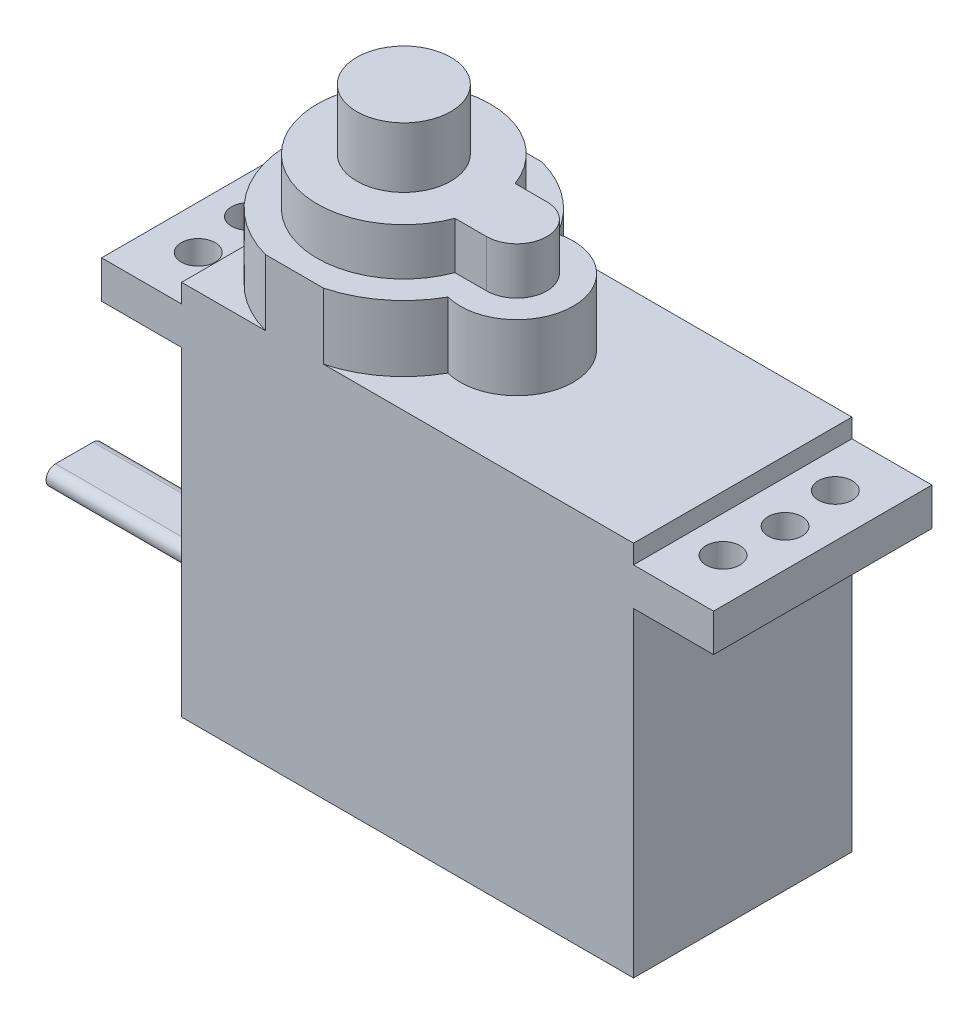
ISO-10303-21;
HEADER;
FILE_DESCRIPTION(('STEP AP214'),'2;1');
FILE_NAME('part.step','',(''),(''),'','','');
FILE_SCHEMA(('AUTOMOTIVE_DESIGN { 1 0 10303 214 1 1 1 1 }'));
ENDSEC;
DATA;
#1=APPLICATION_CONTEXT('core data for automotive mechanical design processes');
#2=APPLICATION_PROTOCOL_DEFINITION('international standard','automotive_design',2000,#1);
#3=PRODUCT_CONTEXT('',#1,'mechanical');
#4=PRODUCT('Part','Part','',(#3));
#5=PRODUCT_RELATED_PRODUCT_CATEGORY('part','',(#4));
#6=PRODUCT_DEFINITION_FORMATION('','',#4);
#7=PRODUCT_DEFINITION_CONTEXT('part definition',#1,'design');
#8=PRODUCT_DEFINITION('design','',#6,#7);
#9=PRODUCT_DEFINITION_SHAPE('','',#8);
#10=(LENGTH_UNIT() NAMED_UNIT(*) SI_UNIT(.MILLI.,.METRE.));
#11=(NAMED_UNIT(*) PLANE_ANGLE_UNIT() SI_UNIT($,.RADIAN.));
#12=(NAMED_UNIT(*) SI_UNIT($,.STERADIAN.) SOLID_ANGLE_UNIT());
#13=UNCERTAINTY_MEASURE_WITH_UNIT(LENGTH_MEASURE(1.E-05),#10,'distance_accuracy_value','');
#14=(GEOMETRIC_REPRESENTATION_CONTEXT(3) GLOBAL_UNCERTAINTY_ASSIGNED_CONTEXT((#13)) GLOBAL_UNIT_ASSIGNED_CONTEXT((#10,
#11,#12)) REPRESENTATION_CONTEXT('',''));
#15=CARTESIAN_POINT('',(0.,0.,0.));
#16=DIRECTION('',(0.,0.,1.));
#17=DIRECTION('',(1.,0.,0.));
#18=AXIS2_PLACEMENT_3D('',#15,#16,#17);
#19=CARTESIAN_POINT('',(-1.5,5.,2.8));
#20=DIRECTION('',(-1.,0.,0.));
#21=DIRECTION('',(0.,0.,1.));
#22=AXIS2_PLACEMENT_3D('',#19,#20,#21);
#23=PLANE('',#22);
#24=DIRECTION('',(0.,-1.,0.));
#25=VECTOR('',#24,1.);
#26=CARTESIAN_POINT('',(-1.5,5.,2.8));
#27=LINE('',#26,#25);
#28=CARTESIAN_POINT('',(-1.5,5.,2.8));
#29=VERTEX_POINT('',#28);
#30=CARTESIAN_POINT('',(-1.5,1.,2.8));
#31=VERTEX_POINT('',#30);
#32=EDGE_CURVE('E268',#29,#31,#27,.T.);
#33=ORIENTED_EDGE('',*,*,#32,.T.);
#34=DIRECTION('',(0.,0.,1.));
#35=VECTOR('',#34,1.);
#36=CARTESIAN_POINT('',(-1.5,1.,2.8));
#37=LINE('',#36,#35);
#38=CARTESIAN_POINT('',(-1.5,1.,8.8));
#39=VERTEX_POINT('',#38);
#40=EDGE_CURVE('E271',#31,#39,#37,.T.);
#41=ORIENTED_EDGE('',*,*,#40,.T.);
#42=DIRECTION('',(0.,1.,0.));
#43=VECTOR('',#42,1.);
#44=CARTESIAN_POINT('',(-1.5,5.,8.8));
#45=LINE('',#44,#43);
#46=CARTESIAN_POINT('',(-1.5,5.,8.8));
#47=VERTEX_POINT('',#46);
#48=EDGE_CURVE('E274',#39,#47,#45,.T.);
#49=ORIENTED_EDGE('',*,*,#48,.T.);
#50=DIRECTION('',(0.,0.,-1.));
#51=VECTOR('',#50,1.);
#52=CARTESIAN_POINT('',(-1.5,5.,2.8));
#53=LINE('',#52,#51);
#54=EDGE_CURVE('E276',#47,#29,#53,.T.);
#55=ORIENTED_EDGE('',*,*,#54,.T.);
#56=EDGE_LOOP('',(#33,#41,#49,#55));
#57=FACE_BOUND('',#56,.T.);
#58=DIRECTION('',(0.,0.,1.));
#59=VECTOR('',#58,1.);
#60=CARTESIAN_POINT('',(-1.5,2.5,4.8));
#61=LINE('',#60,#59);
#62=CARTESIAN_POINT('',(-1.5,2.5,4.8));
#63=VERTEX_POINT('',#62);
#64=CARTESIAN_POINT('',(-1.5,2.5,6.8));
#65=VERTEX_POINT('',#64);
#66=EDGE_CURVE('E926',#63,#65,#61,.T.);
#67=ORIENTED_EDGE('',*,*,#66,.F.);
#68=CARTESIAN_POINT('',(-1.5,3.,4.8));
#69=DIRECTION('',(-1.,0.,0.));
#70=DIRECTION('',(0.,0.,1.));
#71=AXIS2_PLACEMENT_3D('',#68,#69,#70);
#72=CIRCLE('',#71,0.499999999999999);
#73=CARTESIAN_POINT('',(-1.5,3.5,4.8));
#74=VERTEX_POINT('',#73);
#75=EDGE_CURVE('E259',#74,#63,#72,.T.);
#76=ORIENTED_EDGE('',*,*,#75,.F.);
#77=DIRECTION('',(0.,0.,-1.));
#78=VECTOR('',#77,1.);
#79=CARTESIAN_POINT('',(-1.5,3.5,6.8));
#80=LINE('',#79,#78);
#81=CARTESIAN_POINT('',(-1.5,3.5,6.8));
#82=VERTEX_POINT('',#81);
#83=EDGE_CURVE('E255',#82,#74,#80,.T.);
#84=ORIENTED_EDGE('',*,*,#83,.F.);
#85=CARTESIAN_POINT('',(-1.5,3.,6.8));
#86=DIRECTION('',(-1.,0.,0.));
#87=DIRECTION('',(0.,0.,1.));
#88=AXIS2_PLACEMENT_3D('',#85,#86,#87);
#89=CIRCLE('',#88,0.499999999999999);
#90=EDGE_CURVE('E923',#65,#82,#89,.T.);
#91=ORIENTED_EDGE('',*,*,#90,.F.);
#92=EDGE_LOOP('',(#67,#76,#84,#91));
#93=FACE_BOUND('',#92,.T.);
#94=ADVANCED_FACE('F34',(#57,#93),#23,.T.);
#95=CARTESIAN_POINT('',(0.,0.,11.6));
#96=DIRECTION('',(1.,0.,0.));
#97=DIRECTION('',(0.,0.,-1.));
#98=AXIS2_PLACEMENT_3D('',#95,#96,#97);
#99=PLANE('',#98);
#100=DIRECTION('',(0.,-1.,0.));
#101=VECTOR('',#100,1.);
#102=CARTESIAN_POINT('',(0.,0.,0.));
#103=LINE('',#102,#101);
#104=CARTESIAN_POINT('',(0.,17.,0.));
#105=VERTEX_POINT('',#104);
#106=CARTESIAN_POINT('',(0.,0.,0.));
#107=VERTEX_POINT('',#106);
#108=EDGE_CURVE('E406',#105,#107,#103,.T.);
#109=ORIENTED_EDGE('',*,*,#108,.T.);
#110=DIRECTION('',(0.,0.,-1.));
#111=VECTOR('',#110,1.);
#112=CARTESIAN_POINT('',(0.,0.,11.6));
#113=LINE('',#112,#111);
#114=CARTESIAN_POINT('',(0.,0.,11.6));
#115=VERTEX_POINT('',#114);
#116=EDGE_CURVE('E43',#115,#107,#113,.T.);
#117=ORIENTED_EDGE('',*,*,#116,.F.);
#118=DIRECTION('',(0.,-1.,0.));
#119=VECTOR('',#118,1.);
#120=CARTESIAN_POINT('',(0.,0.,11.6));
#121=LINE('',#120,#119);
#122=CARTESIAN_POINT('',(0.,17.,11.6));
#123=VERTEX_POINT('',#122);
#124=EDGE_CURVE('E407',#123,#115,#121,.T.);
#125=ORIENTED_EDGE('',*,*,#124,.F.);
#126=DIRECTION('',(0.,0.,-1.));
#127=VECTOR('',#126,1.);
#128=CARTESIAN_POINT('',(0.,17.,11.6));
#129=LINE('',#128,#127);
#130=EDGE_CURVE('E452',#123,#105,#129,.T.);
#131=ORIENTED_EDGE('',*,*,#130,.T.);
#132=EDGE_LOOP('',(#109,#117,#125,#131));
#133=FACE_BOUND('',#132,.T.);
#134=DIRECTION('',(0.,-1.,0.));
#135=VECTOR('',#134,1.);
#136=CARTESIAN_POINT('',(0.,5.,2.8));
#137=LINE('',#136,#135);
#138=CARTESIAN_POINT('',(0.,5.,2.8));
#139=VERTEX_POINT('',#138);
#140=CARTESIAN_POINT('',(0.,1.,2.8));
#141=VERTEX_POINT('',#140);
#142=EDGE_CURVE('E261',#139,#141,#137,.T.);
#143=ORIENTED_EDGE('',*,*,#142,.F.);
#144=DIRECTION('',(0.,0.,-1.));
#145=VECTOR('',#144,1.);
#146=CARTESIAN_POINT('',(0.,5.,2.8));
#147=LINE('',#146,#145);
#148=CARTESIAN_POINT('',(0.,5.,8.8));
#149=VERTEX_POINT('',#148);
#150=EDGE_CURVE('E272',#149,#139,#147,.T.);
#151=ORIENTED_EDGE('',*,*,#150,.F.);
#152=DIRECTION('',(0.,1.,0.));
#153=VECTOR('',#152,1.);
#154=CARTESIAN_POINT('',(0.,5.,8.8));
#155=LINE('',#154,#153);
#156=CARTESIAN_POINT('',(0.,1.,8.8));
#157=VERTEX_POINT('',#156);
#158=EDGE_CURVE('E280',#157,#149,#155,.T.);
#159=ORIENTED_EDGE('',*,*,#158,.F.);
#160=DIRECTION('',(0.,0.,1.));
#161=VECTOR('',#160,1.);
#162=CARTESIAN_POINT('',(0.,1.,2.8));
#163=LINE('',#162,#161);
#164=EDGE_CURVE('E59',#141,#157,#163,.T.);
#165=ORIENTED_EDGE('',*,*,#164,.F.);
#166=EDGE_LOOP('',(#143,#151,#159,#165));
#167=FACE_BOUND('',#166,.T.);
#168=ADVANCED_FACE('F36',(#133,#167),#99,.F.);
#169=CARTESIAN_POINT('',(12.,26.,5.8));
#170=DIRECTION('',(0.,1.,0.));
#171=DIRECTION('',(0.,0.,1.));
#172=AXIS2_PLACEMENT_3D('',#169,#170,#171);
#173=PLANE('',#172);
#174=CARTESIAN_POINT('',(12.,26.,5.8));
#175=DIRECTION('',(0.,1.,0.));
#176=DIRECTION('',(0.,0.,1.));
#177=AXIS2_PLACEMENT_3D('',#174,#175,#176);
#178=CIRCLE('',#177,1.6);
#179=CARTESIAN_POINT('',(12.,26.,7.4));
#180=VERTEX_POINT('',#179);
#181=CARTESIAN_POINT('',(12.,26.,4.2));
#182=VERTEX_POINT('',#181);
#183=EDGE_CURVE('E302',#180,#182,#178,.T.);
#184=ORIENTED_EDGE('',*,*,#183,.T.);
#185=DIRECTION('',(-1.,0.,0.));
#186=VECTOR('',#185,1.);
#187=CARTESIAN_POINT('',(12.,26.,4.2));
#188=LINE('',#187,#186);
#189=CARTESIAN_POINT('',(10.3127717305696,26.,4.2));
#190=VERTEX_POINT('',#189);
#191=EDGE_CURVE('E305',#182,#190,#188,.T.);
#192=ORIENTED_EDGE('',*,*,#191,.T.);
#193=CARTESIAN_POINT('',(6.,26.,5.8));
#194=DIRECTION('',(0.,1.,0.));
#195=DIRECTION('',(0.,0.,1.));
#196=AXIS2_PLACEMENT_3D('',#193,#194,#195);
#197=CIRCLE('',#196,4.6);
#198=CARTESIAN_POINT('',(10.3127717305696,26.,7.4));
#199=VERTEX_POINT('',#198);
#200=EDGE_CURVE('E308',#190,#199,#197,.T.);
#201=ORIENTED_EDGE('',*,*,#200,.T.);
#202=DIRECTION('',(1.,0.,0.));
#203=VECTOR('',#202,1.);
#204=CARTESIAN_POINT('',(12.,26.,7.4));
#205=LINE('',#204,#203);
#206=EDGE_CURVE('E310',#199,#180,#205,.T.);
#207=ORIENTED_EDGE('',*,*,#206,.T.);
#208=EDGE_LOOP('',(#184,#192,#201,#207));
#209=FACE_BOUND('',#208,.T.);
#210=CARTESIAN_POINT('',(6.,26.,5.8));
#211=DIRECTION('',(0.,1.,0.));
#212=DIRECTION('',(0.,0.,1.));
#213=AXIS2_PLACEMENT_3D('',#210,#211,#212);
#214=CIRCLE('',#213,2.5);
#215=CARTESIAN_POINT('',(6.,26.,8.3));
#216=VERTEX_POINT('',#215);
#217=EDGE_CURVE('E295',#216,#216,#214,.T.);
#218=ORIENTED_EDGE('',*,*,#217,.F.);
#219=EDGE_LOOP('',(#218));
#220=FACE_BOUND('',#219,.T.);
#221=ADVANCED_FACE('F520',(#209,#220),#173,.T.);
#222=CARTESIAN_POINT('',(6.,23.5,5.8));
#223=DIRECTION('',(0.,1.,0.));
#224=DIRECTION('',(0.,0.,1.));
#225=AXIS2_PLACEMENT_3D('',#222,#223,#224);
#226=PLANE('',#225);
#227=CARTESIAN_POINT('',(6.,23.5,5.8));
#228=DIRECTION('',(0.,1.,0.));
#229=DIRECTION('',(0.,0.,1.));
#230=AXIS2_PLACEMENT_3D('',#227,#228,#229);
#231=CIRCLE('',#230,6.);
#232=CARTESIAN_POINT('',(4.46377085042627,23.5,0.));
#233=VERTEX_POINT('',#232);
#234=CARTESIAN_POINT('',(4.46377085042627,23.5,11.6));
#235=VERTEX_POINT('',#234);
#236=EDGE_CURVE('E331',#233,#235,#231,.T.);
#237=ORIENTED_EDGE('',*,*,#236,.T.);
#238=DIRECTION('',(1.,0.,0.));
#239=VECTOR('',#238,1.);
#240=CARTESIAN_POINT('',(7.53622914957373,23.5,11.6));
#241=LINE('',#240,#239);
#242=CARTESIAN_POINT('',(7.53622914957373,23.5,11.6));
#243=VERTEX_POINT('',#242);
#244=EDGE_CURVE('E334',#235,#243,#241,.T.);
#245=ORIENTED_EDGE('',*,*,#244,.T.);
#246=CARTESIAN_POINT('',(6.,23.5,5.8));
#247=DIRECTION('',(0.,1.,0.));
#248=DIRECTION('',(0.,0.,1.));
#249=AXIS2_PLACEMENT_3D('',#246,#247,#248);
#250=CIRCLE('',#249,6.);
#251=CARTESIAN_POINT('',(11.25,23.5,8.70473750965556));
#252=VERTEX_POINT('',#251);
#253=EDGE_CURVE('E337',#243,#252,#250,.T.);
#254=ORIENTED_EDGE('',*,*,#253,.T.);
#255=CARTESIAN_POINT('',(12.,23.5,5.8));
#256=DIRECTION('',(0.,1.,0.));
#257=DIRECTION('',(0.,0.,1.));
#258=AXIS2_PLACEMENT_3D('',#255,#256,#257);
#259=CIRCLE('',#258,3.);
#260=CARTESIAN_POINT('',(11.25,23.5,2.89526249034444));
#261=VERTEX_POINT('',#260);
#262=EDGE_CURVE('E339',#252,#261,#259,.T.);
#263=ORIENTED_EDGE('',*,*,#262,.T.);
#264=CARTESIAN_POINT('',(6.,23.5,5.8));
#265=DIRECTION('',(0.,1.,0.));
#266=DIRECTION('',(0.,0.,1.));
#267=AXIS2_PLACEMENT_3D('',#264,#265,#266);
#268=CIRCLE('',#267,6.);
#269=CARTESIAN_POINT('',(7.53622914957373,23.5,0.));
#270=VERTEX_POINT('',#269);
#271=EDGE_CURVE('E341',#261,#270,#268,.T.);
#272=ORIENTED_EDGE('',*,*,#271,.T.);
#273=DIRECTION('',(-1.,0.,0.));
#274=VECTOR('',#273,1.);
#275=CARTESIAN_POINT('',(7.53622914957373,23.5,0.));
#276=LINE('',#275,#274);
#277=EDGE_CURVE('E343',#270,#233,#276,.T.);
#278=ORIENTED_EDGE('',*,*,#277,.T.);
#279=EDGE_LOOP('',(#237,#245,#254,#263,#272,#278));
#280=FACE_BOUND('',#279,.T.);
#281=DIRECTION('',(-1.,0.,0.));
#282=VECTOR('',#281,1.);
#283=CARTESIAN_POINT('',(12.,23.5,4.2));
#284=LINE('',#283,#282);
#285=CARTESIAN_POINT('',(12.,23.5,4.2));
#286=VERTEX_POINT('',#285);
#287=CARTESIAN_POINT('',(10.3127717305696,23.5,4.2));
#288=VERTEX_POINT('',#287);
#289=EDGE_CURVE('E315',#286,#288,#284,.T.);
#290=ORIENTED_EDGE('',*,*,#289,.F.);
#291=CARTESIAN_POINT('',(12.,23.5,5.8));
#292=DIRECTION('',(0.,1.,0.));
#293=DIRECTION('',(0.,0.,1.));
#294=AXIS2_PLACEMENT_3D('',#291,#292,#293);
#295=CIRCLE('',#294,1.6);
#296=CARTESIAN_POINT('',(12.,23.5,7.4));
#297=VERTEX_POINT('',#296);
#298=EDGE_CURVE('E299',#297,#286,#295,.T.);
#299=ORIENTED_EDGE('',*,*,#298,.F.);
#300=DIRECTION('',(1.,0.,0.));
#301=VECTOR('',#300,1.);
#302=CARTESIAN_POINT('',(12.,23.5,7.4));
#303=LINE('',#302,#301);
#304=CARTESIAN_POINT('',(10.3127717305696,23.5,7.4));
#305=VERTEX_POINT('',#304);
#306=EDGE_CURVE('E306',#305,#297,#303,.T.);
#307=ORIENTED_EDGE('',*,*,#306,.F.);
#308=CARTESIAN_POINT('',(6.,23.5,5.8));
#309=DIRECTION('',(0.,1.,0.));
#310=DIRECTION('',(0.,0.,1.));
#311=AXIS2_PLACEMENT_3D('',#308,#309,#310);
#312=CIRCLE('',#311,4.6);
#313=EDGE_CURVE('E317',#288,#305,#312,.T.);
#314=ORIENTED_EDGE('',*,*,#313,.F.);
#315=EDGE_LOOP('',(#290,#299,#307,#314));
#316=FACE_BOUND('',#315,.T.);
#317=ADVANCED_FACE('F553',(#280,#316),#226,.T.);
#318=CARTESIAN_POINT('',(0.,20.,11.6));
#319=DIRECTION('',(0.,-1.,0.));
#320=DIRECTION('',(0.,0.,-1.));
#321=AXIS2_PLACEMENT_3D('',#318,#319,#320);
#322=PLANE('',#321);
#323=CARTESIAN_POINT('',(6.,20.,5.8));
#324=DIRECTION('',(0.,1.,0.));
#325=DIRECTION('',(0.,0.,1.));
#326=AXIS2_PLACEMENT_3D('',#323,#324,#325);
#327=CIRCLE('',#326,6.);
#328=CARTESIAN_POINT('',(4.46377085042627,20.,0.));
#329=VERTEX_POINT('',#328);
#330=CARTESIAN_POINT('',(0.,20.,5.8));
#331=VERTEX_POINT('',#330);
#332=EDGE_CURVE('E330',#329,#331,#327,.T.);
#333=ORIENTED_EDGE('',*,*,#332,.F.);
#334=DIRECTION('',(-1.,0.,0.));
#335=VECTOR('',#334,1.);
#336=CARTESIAN_POINT('',(0.,20.,0.));
#337=LINE('',#336,#335);
#338=CARTESIAN_POINT('',(0.,20.,0.));
#339=VERTEX_POINT('',#338);
#340=EDGE_CURVE('E433',#329,#339,#337,.T.);
#341=ORIENTED_EDGE('',*,*,#340,.T.);
#342=DIRECTION('',(0.,0.,-1.));
#343=VECTOR('',#342,1.);
#344=CARTESIAN_POINT('',(0.,20.,11.6));
#345=LINE('',#344,#343);
#346=EDGE_CURVE('E465',#331,#339,#345,.T.);
#347=ORIENTED_EDGE('',*,*,#346,.F.);
#348=EDGE_LOOP('',(#333,#341,#347));
#349=FACE_BOUND('',#348,.T.);
#350=ADVANCED_FACE('F573',(#349),#322,.F.);
#351=CARTESIAN_POINT('',(4.46377085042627,20.,11.6));
#352=VERTEX_POINT('',#351);
#353=EDGE_CURVE('E11',#331,#352,#327,.T.);
#354=ORIENTED_EDGE('',*,*,#353,.F.);
#355=CARTESIAN_POINT('',(0.,20.,11.6));
#356=VERTEX_POINT('',#355);
#357=EDGE_CURVE('E466',#356,#331,#345,.T.);
#358=ORIENTED_EDGE('',*,*,#357,.F.);
#359=DIRECTION('',(-1.,0.,0.));
#360=VECTOR('',#359,1.);
#361=CARTESIAN_POINT('',(0.,20.,11.6));
#362=LINE('',#361,#360);
#363=EDGE_CURVE('E423',#352,#356,#362,.T.);
#364=ORIENTED_EDGE('',*,*,#363,.F.);
#365=EDGE_LOOP('',(#354,#358,#364));
#366=FACE_BOUND('',#365,.T.);
#367=ADVANCED_FACE('F720',(#366),#322,.F.);
#368=CARTESIAN_POINT('',(6.,20.,5.8));
#369=DIRECTION('',(0.,1.,0.));
#370=DIRECTION('',(0.,0.,1.));
#371=AXIS2_PLACEMENT_3D('',#368,#369,#370);
#372=CIRCLE('',#371,6.);
#373=CARTESIAN_POINT('',(11.25,20.,2.89526249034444));
#374=VERTEX_POINT('',#373);
#375=CARTESIAN_POINT('',(7.53622914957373,20.,0.));
#376=VERTEX_POINT('',#375);
#377=EDGE_CURVE('E335',#374,#376,#372,.T.);
#378=ORIENTED_EDGE('',*,*,#377,.F.);
#379=CARTESIAN_POINT('',(12.,20.,5.8));
#380=DIRECTION('',(0.,1.,0.));
#381=DIRECTION('',(0.,0.,1.));
#382=AXIS2_PLACEMENT_3D('',#379,#380,#381);
#383=CIRCLE('',#382,3.);
#384=CARTESIAN_POINT('',(11.25,20.,8.70473750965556));
#385=VERTEX_POINT('',#384);
#386=EDGE_CURVE('E348',#385,#374,#383,.T.);
#387=ORIENTED_EDGE('',*,*,#386,.F.);
#388=CARTESIAN_POINT('',(6.,20.,5.8));
#389=DIRECTION('',(0.,1.,0.));
#390=DIRECTION('',(0.,0.,1.));
#391=AXIS2_PLACEMENT_3D('',#388,#389,#390);
#392=CIRCLE('',#391,6.);
#393=CARTESIAN_POINT('',(7.53622914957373,20.,11.6));
#394=VERTEX_POINT('',#393);
#395=EDGE_CURVE('E357',#394,#385,#392,.T.);
#396=ORIENTED_EDGE('',*,*,#395,.F.);
#397=CARTESIAN_POINT('',(24.,20.,11.6));
#398=VERTEX_POINT('',#397);
#399=EDGE_CURVE('E430',#398,#394,#362,.T.);
#400=ORIENTED_EDGE('',*,*,#399,.F.);
#401=DIRECTION('',(0.,0.,-1.));
#402=VECTOR('',#401,1.);
#403=CARTESIAN_POINT('',(24.,20.,11.6));
#404=LINE('',#403,#402);
#405=CARTESIAN_POINT('',(24.,20.,0.));
#406=VERTEX_POINT('',#405);
#407=EDGE_CURVE('E469',#398,#406,#404,.T.);
#408=ORIENTED_EDGE('',*,*,#407,.T.);
#409=EDGE_CURVE('E437',#406,#376,#337,.T.);
#410=ORIENTED_EDGE('',*,*,#409,.T.);
#411=EDGE_LOOP('',(#378,#387,#396,#400,#408,#410));
#412=FACE_BOUND('',#411,.T.);
#413=ADVANCED_FACE('F683',(#412),#322,.F.);
#414=CARTESIAN_POINT('',(0.,0.,11.6));
#415=DIRECTION('',(0.,1.,0.));
#416=DIRECTION('',(0.,0.,1.));
#417=AXIS2_PLACEMENT_3D('',#414,#415,#416);
#418=PLANE('',#417);
#419=DIRECTION('',(1.,0.,0.));
#420=VECTOR('',#419,1.);
#421=CARTESIAN_POINT('',(0.,0.,0.));
#422=LINE('',#421,#420);
#423=CARTESIAN_POINT('',(24.,0.,0.));
#424=VERTEX_POINT('',#423);
#425=EDGE_CURVE('E630',#107,#424,#422,.T.);
#426=ORIENTED_EDGE('',*,*,#425,.T.);
#427=DIRECTION('',(0.,0.,-1.));
#428=VECTOR('',#427,1.);
#429=CARTESIAN_POINT('',(24.,0.,11.6));
#430=LINE('',#429,#428);
#431=CARTESIAN_POINT('',(24.,0.,11.6));
#432=VERTEX_POINT('',#431);
#433=EDGE_CURVE('E484',#432,#424,#430,.T.);
#434=ORIENTED_EDGE('',*,*,#433,.F.);
#435=DIRECTION('',(1.,0.,0.));
#436=VECTOR('',#435,1.);
#437=CARTESIAN_POINT('',(0.,0.,11.6));
#438=LINE('',#437,#436);
#439=EDGE_CURVE('E410',#115,#432,#438,.T.);
#440=ORIENTED_EDGE('',*,*,#439,.F.);
#441=ORIENTED_EDGE('',*,*,#116,.T.);
#442=EDGE_LOOP('',(#426,#434,#440,#441));
#443=FACE_BOUND('',#442,.T.);
#444=ADVANCED_FACE('F663',(#443),#418,.F.);
#445=CARTESIAN_POINT('',(24.,0.,11.6));
#446=DIRECTION('',(-1.,0.,0.));
#447=DIRECTION('',(0.,0.,1.));
#448=AXIS2_PLACEMENT_3D('',#445,#446,#447);
#449=PLANE('',#448);
#450=DIRECTION('',(0.,1.,0.));
#451=VECTOR('',#450,1.);
#452=CARTESIAN_POINT('',(24.,0.,0.));
#453=LINE('',#452,#451);
#454=CARTESIAN_POINT('',(24.,17.,0.));
#455=VERTEX_POINT('',#454);
#456=EDGE_CURVE('E618',#424,#455,#453,.T.);
#457=ORIENTED_EDGE('',*,*,#456,.T.);
#458=DIRECTION('',(0.,0.,-1.));
#459=VECTOR('',#458,1.);
#460=CARTESIAN_POINT('',(24.,17.,11.6));
#461=LINE('',#460,#459);
#462=CARTESIAN_POINT('',(24.,17.,11.6));
#463=VERTEX_POINT('',#462);
#464=EDGE_CURVE('E481',#463,#455,#461,.T.);
#465=ORIENTED_EDGE('',*,*,#464,.F.);
#466=DIRECTION('',(0.,1.,0.));
#467=VECTOR('',#466,1.);
#468=CARTESIAN_POINT('',(24.,0.,11.6));
#469=LINE('',#468,#467);
#470=EDGE_CURVE('E413',#432,#463,#469,.T.);
#471=ORIENTED_EDGE('',*,*,#470,.F.);
#472=ORIENTED_EDGE('',*,*,#433,.T.);
#473=EDGE_LOOP('',(#457,#465,#471,#472));
#474=FACE_BOUND('',#473,.T.);
#475=ADVANCED_FACE('F602',(#474),#449,.F.);
#476=CARTESIAN_POINT('',(24.,17.,11.6));
#477=DIRECTION('',(0.,1.,0.));
#478=DIRECTION('',(0.,0.,1.));
#479=AXIS2_PLACEMENT_3D('',#476,#477,#478);
#480=PLANE('',#479);
#481=CARTESIAN_POINT('',(25.9342105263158,17.,2.8166667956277));
#482=DIRECTION('',(0.,1.,0.));
#483=DIRECTION('',(0.,0.,1.));
#484=AXIS2_PLACEMENT_3D('',#481,#482,#483);
#485=CIRCLE('',#484,0.9);
#486=CARTESIAN_POINT('',(25.9342105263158,17.,3.7166667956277));
#487=VERTEX_POINT('',#486);
#488=EDGE_CURVE('E378',#487,#487,#485,.T.);
#489=ORIENTED_EDGE('',*,*,#488,.T.);
#490=EDGE_LOOP('',(#489));
#491=FACE_BOUND('',#490,.T.);
#492=CARTESIAN_POINT('',(25.9342105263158,17.,8.78333320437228));
#493=DIRECTION('',(0.,1.,0.));
#494=DIRECTION('',(0.,0.,1.));
#495=AXIS2_PLACEMENT_3D('',#492,#493,#494);
#496=CIRCLE('',#495,0.9);
#497=CARTESIAN_POINT('',(25.9342105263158,17.,9.68333320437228));
#498=VERTEX_POINT('',#497);
#499=EDGE_CURVE('E385',#498,#498,#496,.T.);
#500=ORIENTED_EDGE('',*,*,#499,.T.);
#501=EDGE_LOOP('',(#500));
#502=FACE_BOUND('',#501,.T.);
#503=CARTESIAN_POINT('',(26.25,17.,5.79999999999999));
#504=DIRECTION('',(0.,1.,0.));
#505=DIRECTION('',(0.,0.,1.));
#506=AXIS2_PLACEMENT_3D('',#503,#504,#505);
#507=CIRCLE('',#506,0.9);
#508=CARTESIAN_POINT('',(26.25,17.,6.69999999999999));
#509=VERTEX_POINT('',#508);
#510=EDGE_CURVE('E403',#509,#509,#507,.T.);
#511=ORIENTED_EDGE('',*,*,#510,.T.);
#512=EDGE_LOOP('',(#511));
#513=FACE_BOUND('',#512,.T.);
#514=DIRECTION('',(1.,0.,0.));
#515=VECTOR('',#514,1.);
#516=CARTESIAN_POINT('',(24.,17.,0.));
#517=LINE('',#516,#515);
#518=CARTESIAN_POINT('',(28.25,17.,0.));
#519=VERTEX_POINT('',#518);
#520=EDGE_CURVE('E610',#455,#519,#517,.T.);
#521=ORIENTED_EDGE('',*,*,#520,.T.);
#522=DIRECTION('',(0.,0.,-1.));
#523=VECTOR('',#522,1.);
#524=CARTESIAN_POINT('',(28.25,17.,11.6));
#525=LINE('',#524,#523);
#526=CARTESIAN_POINT('',(28.25,17.,11.6));
#527=VERTEX_POINT('',#526);
#528=EDGE_CURVE('E478',#527,#519,#525,.T.);
#529=ORIENTED_EDGE('',*,*,#528,.F.);
#530=DIRECTION('',(1.,0.,0.));
#531=VECTOR('',#530,1.);
#532=CARTESIAN_POINT('',(24.,17.,11.6));
#533=LINE('',#532,#531);
#534=EDGE_CURVE('E415',#463,#527,#533,.T.);
#535=ORIENTED_EDGE('',*,*,#534,.F.);
#536=ORIENTED_EDGE('',*,*,#464,.T.);
#537=EDGE_LOOP('',(#521,#529,#535,#536));
#538=FACE_BOUND('',#537,.T.);
#539=ADVANCED_FACE('F598',(#491,#502,#513,#538),#480,.F.);
#540=CARTESIAN_POINT('',(28.25,17.,11.6));
#541=DIRECTION('',(-1.,0.,0.));
#542=DIRECTION('',(0.,0.,1.));
#543=AXIS2_PLACEMENT_3D('',#540,#541,#542);
#544=PLANE('',#543);
#545=DIRECTION('',(0.,1.,0.));
#546=VECTOR('',#545,1.);
#547=CARTESIAN_POINT('',(28.25,17.,0.));
#548=LINE('',#547,#546);
#549=CARTESIAN_POINT('',(28.25,19.,0.));
#550=VERTEX_POINT('',#549);
#551=EDGE_CURVE('E617',#519,#550,#548,.T.);
#552=ORIENTED_EDGE('',*,*,#551,.T.);
#553=DIRECTION('',(0.,0.,-1.));
#554=VECTOR('',#553,1.);
#555=CARTESIAN_POINT('',(28.25,19.,11.6));
#556=LINE('',#555,#554);
#557=CARTESIAN_POINT('',(28.25,19.,11.6));
#558=VERTEX_POINT('',#557);
#559=EDGE_CURVE('E475',#558,#550,#556,.T.);
#560=ORIENTED_EDGE('',*,*,#559,.F.);
#561=DIRECTION('',(0.,1.,0.));
#562=VECTOR('',#561,1.);
#563=CARTESIAN_POINT('',(28.25,17.,11.6));
#564=LINE('',#563,#562);
#565=EDGE_CURVE('E417',#527,#558,#564,.T.);
#566=ORIENTED_EDGE('',*,*,#565,.F.);
#567=ORIENTED_EDGE('',*,*,#528,.T.);
#568=EDGE_LOOP('',(#552,#560,#566,#567));
#569=FACE_BOUND('',#568,.T.);
#570=ADVANCED_FACE('F601',(#569),#544,.F.);
#571=CARTESIAN_POINT('',(28.25,19.,11.6));
#572=DIRECTION('',(0.,-1.,0.));
#573=DIRECTION('',(1.,0.,0.));
#574=AXIS2_PLACEMENT_3D('',#571,#572,#573);
#575=PLANE('',#574);
#576=CARTESIAN_POINT('',(25.9342105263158,19.,2.8166667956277));
#577=DIRECTION('',(0.,1.,0.));
#578=DIRECTION('',(0.,0.,1.));
#579=AXIS2_PLACEMENT_3D('',#576,#577,#578);
#580=CIRCLE('',#579,0.9);
#581=CARTESIAN_POINT('',(25.9342105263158,19.,3.7166667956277));
#582=VERTEX_POINT('',#581);
#583=EDGE_CURVE('E375',#582,#582,#580,.T.);
#584=ORIENTED_EDGE('',*,*,#583,.F.);
#585=EDGE_LOOP('',(#584));
#586=FACE_BOUND('',#585,.T.);
#587=CARTESIAN_POINT('',(25.9342105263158,19.,8.78333320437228));
#588=DIRECTION('',(0.,1.,0.));
#589=DIRECTION('',(0.,0.,1.));
#590=AXIS2_PLACEMENT_3D('',#587,#588,#589);
#591=CIRCLE('',#590,0.9);
#592=CARTESIAN_POINT('',(25.9342105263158,19.,9.68333320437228));
#593=VERTEX_POINT('',#592);
#594=EDGE_CURVE('E382',#593,#593,#591,.T.);
#595=ORIENTED_EDGE('',*,*,#594,.F.);
#596=EDGE_LOOP('',(#595));
#597=FACE_BOUND('',#596,.T.);
#598=CARTESIAN_POINT('',(26.25,19.,5.79999999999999));
#599=DIRECTION('',(0.,1.,0.));
#600=DIRECTION('',(0.,0.,1.));
#601=AXIS2_PLACEMENT_3D('',#598,#599,#600);
#602=CIRCLE('',#601,0.9);
#603=CARTESIAN_POINT('',(26.25,19.,6.69999999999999));
#604=VERTEX_POINT('',#603);
#605=EDGE_CURVE('E400',#604,#604,#602,.T.);
#606=ORIENTED_EDGE('',*,*,#605,.F.);
#607=EDGE_LOOP('',(#606));
#608=FACE_BOUND('',#607,.T.);
#609=DIRECTION('',(-1.,0.,0.));
#610=VECTOR('',#609,1.);
#611=CARTESIAN_POINT('',(28.25,19.,0.));
#612=LINE('',#611,#610);
#613=CARTESIAN_POINT('',(24.,19.,0.));
#614=VERTEX_POINT('',#613);
#615=EDGE_CURVE('E626',#550,#614,#612,.T.);
#616=ORIENTED_EDGE('',*,*,#615,.T.);
#617=DIRECTION('',(0.,0.,-1.));
#618=VECTOR('',#617,1.);
#619=CARTESIAN_POINT('',(24.,19.,11.6));
#620=LINE('',#619,#618);
#621=CARTESIAN_POINT('',(24.,19.,11.6));
#622=VERTEX_POINT('',#621);
#623=EDGE_CURVE('E472',#622,#614,#620,.T.);
#624=ORIENTED_EDGE('',*,*,#623,.F.);
#625=DIRECTION('',(-1.,0.,0.));
#626=VECTOR('',#625,1.);
#627=CARTESIAN_POINT('',(28.25,19.,11.6));
#628=LINE('',#627,#626);
#629=EDGE_CURVE('E419',#558,#622,#628,.T.);
#630=ORIENTED_EDGE('',*,*,#629,.F.);
#631=ORIENTED_EDGE('',*,*,#559,.T.);
#632=EDGE_LOOP('',(#616,#624,#630,#631));
#633=FACE_BOUND('',#632,.T.);
#634=ADVANCED_FACE('F702',(#586,#597,#608,#633),#575,.F.);
#635=CARTESIAN_POINT('',(24.,19.,11.6));
#636=DIRECTION('',(-1.,0.,0.));
#637=DIRECTION('',(0.,0.,1.));
#638=AXIS2_PLACEMENT_3D('',#635,#636,#637);
#639=PLANE('',#638);
#640=DIRECTION('',(0.,1.,0.));
#641=VECTOR('',#640,1.);
#642=CARTESIAN_POINT('',(24.,19.,0.));
#643=LINE('',#642,#641);
#644=EDGE_CURVE('E438',#614,#406,#643,.T.);
#645=ORIENTED_EDGE('',*,*,#644,.T.);
#646=ORIENTED_EDGE('',*,*,#407,.F.);
#647=DIRECTION('',(0.,1.,0.));
#648=VECTOR('',#647,1.);
#649=CARTESIAN_POINT('',(24.,19.,11.6));
#650=LINE('',#649,#648);
#651=EDGE_CURVE('E421',#622,#398,#650,.T.);
#652=ORIENTED_EDGE('',*,*,#651,.F.);
#653=ORIENTED_EDGE('',*,*,#623,.T.);
#654=EDGE_LOOP('',(#645,#646,#652,#653));
#655=FACE_BOUND('',#654,.T.);
#656=ADVANCED_FACE('F698',(#655),#639,.F.);
#657=CARTESIAN_POINT('',(0.,19.,11.6));
#658=DIRECTION('',(1.,0.,0.));
#659=DIRECTION('',(0.,1.,0.));
#660=AXIS2_PLACEMENT_3D('',#657,#658,#659);
#661=PLANE('',#660);
#662=DIRECTION('',(0.,-1.,0.));
#663=VECTOR('',#662,1.);
#664=CARTESIAN_POINT('',(0.,19.,0.));
#665=LINE('',#664,#663);
#666=CARTESIAN_POINT('',(0.,19.,0.));
#667=VERTEX_POINT('',#666);
#668=EDGE_CURVE('E444',#339,#667,#665,.T.);
#669=ORIENTED_EDGE('',*,*,#668,.T.);
#670=DIRECTION('',(0.,0.,-1.));
#671=VECTOR('',#670,1.);
#672=CARTESIAN_POINT('',(0.,19.,11.6));
#673=LINE('',#672,#671);
#674=CARTESIAN_POINT('',(0.,19.,11.6));
#675=VERTEX_POINT('',#674);
#676=EDGE_CURVE('E462',#675,#667,#673,.T.);
#677=ORIENTED_EDGE('',*,*,#676,.F.);
#678=DIRECTION('',(0.,-1.,0.));
#679=VECTOR('',#678,1.);
#680=CARTESIAN_POINT('',(0.,19.,11.6));
#681=LINE('',#680,#679);
#682=EDGE_CURVE('E426',#356,#675,#681,.T.);
#683=ORIENTED_EDGE('',*,*,#682,.F.);
#684=ORIENTED_EDGE('',*,*,#357,.T.);
#685=ORIENTED_EDGE('',*,*,#346,.T.);
#686=EDGE_LOOP('',(#669,#677,#683,#684,#685));
#687=FACE_BOUND('',#686,.T.);
#688=ADVANCED_FACE('F646',(#687),#661,.F.);
#689=CARTESIAN_POINT('',(0.,19.,11.6));
#690=DIRECTION('',(0.,-1.,0.));
#691=DIRECTION('',(0.,0.,-1.));
#692=AXIS2_PLACEMENT_3D('',#689,#690,#691);
#693=PLANE('',#692);
#694=CARTESIAN_POINT('',(-1.93421052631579,19.,8.78333320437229));
#695=DIRECTION('',(0.,1.,0.));
#696=DIRECTION('',(0.,0.,1.));
#697=AXIS2_PLACEMENT_3D('',#694,#695,#696);
#698=CIRCLE('',#697,0.9);
#699=CARTESIAN_POINT('',(-1.93421052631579,19.,9.68333320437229));
#700=VERTEX_POINT('',#699);
#701=EDGE_CURVE('E388',#700,#700,#698,.T.);
#702=ORIENTED_EDGE('',*,*,#701,.F.);
#703=EDGE_LOOP('',(#702));
#704=FACE_BOUND('',#703,.T.);
#705=CARTESIAN_POINT('',(-1.93421052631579,19.,2.81666679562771));
#706=DIRECTION('',(0.,1.,0.));
#707=DIRECTION('',(0.,0.,1.));
#708=AXIS2_PLACEMENT_3D('',#705,#706,#707);
#709=CIRCLE('',#708,0.9);
#710=CARTESIAN_POINT('',(-1.93421052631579,19.,3.71666679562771));
#711=VERTEX_POINT('',#710);
#712=EDGE_CURVE('E392',#711,#711,#709,.T.);
#713=ORIENTED_EDGE('',*,*,#712,.F.);
#714=EDGE_LOOP('',(#713));
#715=FACE_BOUND('',#714,.T.);
#716=CARTESIAN_POINT('',(-2.25,19.,5.8));
#717=DIRECTION('',(0.,1.,0.));
#718=DIRECTION('',(0.,0.,1.));
#719=AXIS2_PLACEMENT_3D('',#716,#717,#718);
#720=CIRCLE('',#719,0.9);
#721=CARTESIAN_POINT('',(-2.25,19.,6.7));
#722=VERTEX_POINT('',#721);
#723=EDGE_CURVE('E396',#722,#722,#720,.T.);
#724=ORIENTED_EDGE('',*,*,#723,.F.);
#725=EDGE_LOOP('',(#724));
#726=FACE_BOUND('',#725,.T.);
#727=DIRECTION('',(-1.,0.,0.));
#728=VECTOR('',#727,1.);
#729=CARTESIAN_POINT('',(0.,19.,0.));
#730=LINE('',#729,#728);
#731=CARTESIAN_POINT('',(-4.25,19.,0.));
#732=VERTEX_POINT('',#731);
#733=EDGE_CURVE('E447',#667,#732,#730,.T.);
#734=ORIENTED_EDGE('',*,*,#733,.T.);
#735=DIRECTION('',(0.,0.,-1.));
#736=VECTOR('',#735,1.);
#737=CARTESIAN_POINT('',(-4.25,19.,11.6));
#738=LINE('',#737,#736);
#739=CARTESIAN_POINT('',(-4.25,19.,11.6));
#740=VERTEX_POINT('',#739);
#741=EDGE_CURVE('E459',#740,#732,#738,.T.);
#742=ORIENTED_EDGE('',*,*,#741,.F.);
#743=DIRECTION('',(-1.,0.,0.));
#744=VECTOR('',#743,1.);
#745=CARTESIAN_POINT('',(0.,19.,11.6));
#746=LINE('',#745,#744);
#747=EDGE_CURVE('E636',#675,#740,#746,.T.);
#748=ORIENTED_EDGE('',*,*,#747,.F.);
#749=ORIENTED_EDGE('',*,*,#676,.T.);
#750=EDGE_LOOP('',(#734,#742,#748,#749));
#751=FACE_BOUND('',#750,.T.);
#752=ADVANCED_FACE('F650',(#704,#715,#726,#751),#693,.F.);
#753=CARTESIAN_POINT('',(-4.25,17.,11.6));
#754=DIRECTION('',(1.,0.,0.));
#755=DIRECTION('',(0.,1.,0.));
#756=AXIS2_PLACEMENT_3D('',#753,#754,#755);
#757=PLANE('',#756);
#758=DIRECTION('',(0.,-1.,0.));
#759=VECTOR('',#758,1.);
#760=CARTESIAN_POINT('',(-4.25,17.,0.));
#761=LINE('',#760,#759);
#762=CARTESIAN_POINT('',(-4.25,17.,0.));
#763=VERTEX_POINT('',#762);
#764=EDGE_CURVE('E449',#732,#763,#761,.T.);
#765=ORIENTED_EDGE('',*,*,#764,.T.);
#766=DIRECTION('',(0.,0.,-1.));
#767=VECTOR('',#766,1.);
#768=CARTESIAN_POINT('',(-4.25,17.,11.6));
#769=LINE('',#768,#767);
#770=CARTESIAN_POINT('',(-4.25,17.,11.6));
#771=VERTEX_POINT('',#770);
#772=EDGE_CURVE('E455',#771,#763,#769,.T.);
#773=ORIENTED_EDGE('',*,*,#772,.F.);
#774=DIRECTION('',(0.,-1.,0.));
#775=VECTOR('',#774,1.);
#776=CARTESIAN_POINT('',(-4.25,17.,11.6));
#777=LINE('',#776,#775);
#778=EDGE_CURVE('E635',#740,#771,#777,.T.);
#779=ORIENTED_EDGE('',*,*,#778,.F.);
#780=ORIENTED_EDGE('',*,*,#741,.T.);
#781=EDGE_LOOP('',(#765,#773,#779,#780));
#782=FACE_BOUND('',#781,.T.);
#783=ADVANCED_FACE('F655',(#782),#757,.F.);
#784=CARTESIAN_POINT('',(-4.25,17.,11.6));
#785=DIRECTION('',(0.,1.,0.));
#786=DIRECTION('',(0.,0.,1.));
#787=AXIS2_PLACEMENT_3D('',#784,#785,#786);
#788=PLANE('',#787);
#789=CARTESIAN_POINT('',(-1.93421052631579,17.,8.78333320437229));
#790=DIRECTION('',(0.,1.,0.));
#791=DIRECTION('',(0.,0.,1.));
#792=AXIS2_PLACEMENT_3D('',#789,#790,#791);
#793=CIRCLE('',#792,0.9);
#794=CARTESIAN_POINT('',(-1.93421052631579,17.,9.68333320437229));
#795=VERTEX_POINT('',#794);
#796=EDGE_CURVE('E391',#795,#795,#793,.T.);
#797=ORIENTED_EDGE('',*,*,#796,.T.);
#798=EDGE_LOOP('',(#797));
#799=FACE_BOUND('',#798,.T.);
#800=CARTESIAN_POINT('',(-1.93421052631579,17.,2.81666679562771));
#801=DIRECTION('',(0.,1.,0.));
#802=DIRECTION('',(0.,0.,1.));
#803=AXIS2_PLACEMENT_3D('',#800,#801,#802);
#804=CIRCLE('',#803,0.9);
#805=CARTESIAN_POINT('',(-1.93421052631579,17.,3.71666679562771));
#806=VERTEX_POINT('',#805);
#807=EDGE_CURVE('E395',#806,#806,#804,.T.);
#808=ORIENTED_EDGE('',*,*,#807,.T.);
#809=EDGE_LOOP('',(#808));
#810=FACE_BOUND('',#809,.T.);
#811=CARTESIAN_POINT('',(-2.25,17.,5.8));
#812=DIRECTION('',(0.,1.,0.));
#813=DIRECTION('',(0.,0.,1.));
#814=AXIS2_PLACEMENT_3D('',#811,#812,#813);
#815=CIRCLE('',#814,0.9);
#816=CARTESIAN_POINT('',(-2.25,17.,6.7));
#817=VERTEX_POINT('',#816);
#818=EDGE_CURVE('E399',#817,#817,#815,.T.);
#819=ORIENTED_EDGE('',*,*,#818,.T.);
#820=EDGE_LOOP('',(#819));
#821=FACE_BOUND('',#820,.T.);
#822=DIRECTION('',(1.,0.,0.));
#823=VECTOR('',#822,1.);
#824=CARTESIAN_POINT('',(-4.25,17.,0.));
#825=LINE('',#824,#823);
#826=EDGE_CURVE('E411',#763,#105,#825,.T.);
#827=ORIENTED_EDGE('',*,*,#826,.T.);
#828=ORIENTED_EDGE('',*,*,#130,.F.);
#829=DIRECTION('',(1.,0.,0.));
#830=VECTOR('',#829,1.);
#831=CARTESIAN_POINT('',(-4.25,17.,11.6));
#832=LINE('',#831,#830);
#833=EDGE_CURVE('E456',#771,#123,#832,.T.);
#834=ORIENTED_EDGE('',*,*,#833,.F.);
#835=ORIENTED_EDGE('',*,*,#772,.T.);
#836=EDGE_LOOP('',(#827,#828,#834,#835));
#837=FACE_BOUND('',#836,.T.);
#838=ADVANCED_FACE('F495',(#799,#810,#821,#837),#788,.F.);
#839=CARTESIAN_POINT('',(0.,17.,11.6));
#840=DIRECTION('',(0.,0.,-1.));
#841=DIRECTION('',(-1.,0.,0.));
#842=AXIS2_PLACEMENT_3D('',#839,#840,#841);
#843=PLANE('',#842);
#844=ORIENTED_EDGE('',*,*,#124,.T.);
#845=ORIENTED_EDGE('',*,*,#439,.T.);
#846=ORIENTED_EDGE('',*,*,#470,.T.);
#847=ORIENTED_EDGE('',*,*,#534,.T.);
#848=ORIENTED_EDGE('',*,*,#565,.T.);
#849=ORIENTED_EDGE('',*,*,#629,.T.);
#850=ORIENTED_EDGE('',*,*,#651,.T.);
#851=ORIENTED_EDGE('',*,*,#399,.T.);
#852=DIRECTION('',(0.,-1.,0.));
#853=VECTOR('',#852,1.);
#854=CARTESIAN_POINT('',(7.53622914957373,23.5,11.6));
#855=LINE('',#854,#853);
#856=EDGE_CURVE('E374',#243,#394,#855,.T.);
#857=ORIENTED_EDGE('',*,*,#856,.F.);
#858=ORIENTED_EDGE('',*,*,#244,.F.);
#859=DIRECTION('',(0.,-1.,0.));
#860=VECTOR('',#859,1.);
#861=CARTESIAN_POINT('',(4.46377085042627,23.5,11.6));
#862=LINE('',#861,#860);
#863=EDGE_CURVE('E379',#235,#352,#862,.T.);
#864=ORIENTED_EDGE('',*,*,#863,.T.);
#865=ORIENTED_EDGE('',*,*,#363,.T.);
#866=ORIENTED_EDGE('',*,*,#682,.T.);
#867=ORIENTED_EDGE('',*,*,#747,.T.);
#868=ORIENTED_EDGE('',*,*,#778,.T.);
#869=ORIENTED_EDGE('',*,*,#833,.T.);
#870=EDGE_LOOP('',(#844,#845,#846,#847,#848,#849,#850,#851,#857,#858,#864,#865,#866,#867,#868,#869));
#871=FACE_BOUND('',#870,.T.);
#872=ADVANCED_FACE('F642',(#871),#843,.F.);
#873=CARTESIAN_POINT('',(0.,17.,0.));
#874=DIRECTION('',(0.,0.,-1.));
#875=DIRECTION('',(-1.,0.,0.));
#876=AXIS2_PLACEMENT_3D('',#873,#874,#875);
#877=PLANE('',#876);
#878=ORIENTED_EDGE('',*,*,#108,.F.);
#879=ORIENTED_EDGE('',*,*,#826,.F.);
#880=ORIENTED_EDGE('',*,*,#764,.F.);
#881=ORIENTED_EDGE('',*,*,#733,.F.);
#882=ORIENTED_EDGE('',*,*,#668,.F.);
#883=ORIENTED_EDGE('',*,*,#340,.F.);
#884=DIRECTION('',(0.,-1.,0.));
#885=VECTOR('',#884,1.);
#886=CARTESIAN_POINT('',(4.46377085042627,23.5,0.));
#887=LINE('',#886,#885);
#888=EDGE_CURVE('E345',#233,#329,#887,.T.);
#889=ORIENTED_EDGE('',*,*,#888,.F.);
#890=ORIENTED_EDGE('',*,*,#277,.F.);
#891=DIRECTION('',(0.,-1.,0.));
#892=VECTOR('',#891,1.);
#893=CARTESIAN_POINT('',(7.53622914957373,23.5,0.));
#894=LINE('',#893,#892);
#895=EDGE_CURVE('E362',#270,#376,#894,.T.);
#896=ORIENTED_EDGE('',*,*,#895,.T.);
#897=ORIENTED_EDGE('',*,*,#409,.F.);
#898=ORIENTED_EDGE('',*,*,#644,.F.);
#899=ORIENTED_EDGE('',*,*,#615,.F.);
#900=ORIENTED_EDGE('',*,*,#551,.F.);
#901=ORIENTED_EDGE('',*,*,#520,.F.);
#902=ORIENTED_EDGE('',*,*,#456,.F.);
#903=ORIENTED_EDGE('',*,*,#425,.F.);
#904=EDGE_LOOP('',(#878,#879,#880,#881,#882,#883,#889,#890,#896,#897,#898,#899,#900,#901,#902,#903));
#905=FACE_BOUND('',#904,.T.);
#906=ADVANCED_FACE('F624',(#905),#877,.T.);
#907=CARTESIAN_POINT('',(26.25,0.,5.79999999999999));
#908=DIRECTION('',(0.,1.,0.));
#909=DIRECTION('',(0.,0.,1.));
#910=AXIS2_PLACEMENT_3D('',#907,#908,#909);
#911=CYLINDRICAL_SURFACE('',#910,0.9);
#912=ORIENTED_EDGE('',*,*,#605,.T.);
#913=EDGE_LOOP('',(#912));
#914=FACE_BOUND('',#913,.T.);
#915=ORIENTED_EDGE('',*,*,#510,.F.);
#916=EDGE_LOOP('',(#915));
#917=FACE_BOUND('',#916,.T.);
#918=ADVANCED_FACE('F769',(#914,#917),#911,.F.);
#919=CARTESIAN_POINT('',(-2.25,0.,5.8));
#920=DIRECTION('',(0.,1.,0.));
#921=DIRECTION('',(0.,0.,1.));
#922=AXIS2_PLACEMENT_3D('',#919,#920,#921);
#923=CYLINDRICAL_SURFACE('',#922,0.9);
#924=ORIENTED_EDGE('',*,*,#723,.T.);
#925=EDGE_LOOP('',(#924));
#926=FACE_BOUND('',#925,.T.);
#927=ORIENTED_EDGE('',*,*,#818,.F.);
#928=EDGE_LOOP('',(#927));
#929=FACE_BOUND('',#928,.T.);
#930=ADVANCED_FACE('F511',(#926,#929),#923,.F.);
#931=CARTESIAN_POINT('',(-1.93421052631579,0.,2.81666679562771));
#932=DIRECTION('',(0.,1.,0.));
#933=DIRECTION('',(0.,0.,1.));
#934=AXIS2_PLACEMENT_3D('',#931,#932,#933);
#935=CYLINDRICAL_SURFACE('',#934,0.9);
#936=ORIENTED_EDGE('',*,*,#712,.T.);
#937=EDGE_LOOP('',(#936));
#938=FACE_BOUND('',#937,.T.);
#939=ORIENTED_EDGE('',*,*,#807,.F.);
#940=EDGE_LOOP('',(#939));
#941=FACE_BOUND('',#940,.T.);
#942=ADVANCED_FACE('F501',(#938,#941),#935,.F.);
#943=CARTESIAN_POINT('',(-1.93421052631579,0.,8.78333320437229));
#944=DIRECTION('',(0.,1.,0.));
#945=DIRECTION('',(0.,0.,1.));
#946=AXIS2_PLACEMENT_3D('',#943,#944,#945);
#947=CYLINDRICAL_SURFACE('',#946,0.9);
#948=ORIENTED_EDGE('',*,*,#701,.T.);
#949=EDGE_LOOP('',(#948));
#950=FACE_BOUND('',#949,.T.);
#951=ORIENTED_EDGE('',*,*,#796,.F.);
#952=EDGE_LOOP('',(#951));
#953=FACE_BOUND('',#952,.T.);
#954=ADVANCED_FACE('F498',(#950,#953),#947,.F.);
#955=CARTESIAN_POINT('',(25.9342105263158,0.,8.78333320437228));
#956=DIRECTION('',(0.,1.,0.));
#957=DIRECTION('',(0.,0.,1.));
#958=AXIS2_PLACEMENT_3D('',#955,#956,#957);
#959=CYLINDRICAL_SURFACE('',#958,0.9);
#960=ORIENTED_EDGE('',*,*,#594,.T.);
#961=EDGE_LOOP('',(#960));
#962=FACE_BOUND('',#961,.T.);
#963=ORIENTED_EDGE('',*,*,#499,.F.);
#964=EDGE_LOOP('',(#963));
#965=FACE_BOUND('',#964,.T.);
#966=ADVANCED_FACE('F500',(#962,#965),#959,.F.);
#967=CARTESIAN_POINT('',(25.9342105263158,0.,2.8166667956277));
#968=DIRECTION('',(0.,1.,0.));
#969=DIRECTION('',(0.,0.,1.));
#970=AXIS2_PLACEMENT_3D('',#967,#968,#969);
#971=CYLINDRICAL_SURFACE('',#970,0.9);
#972=ORIENTED_EDGE('',*,*,#583,.T.);
#973=EDGE_LOOP('',(#972));
#974=FACE_BOUND('',#973,.T.);
#975=ORIENTED_EDGE('',*,*,#488,.F.);
#976=EDGE_LOOP('',(#975));
#977=FACE_BOUND('',#976,.T.);
#978=ADVANCED_FACE('F508',(#974,#977),#971,.F.);
#979=CARTESIAN_POINT('',(6.,23.5,5.8));
#980=DIRECTION('',(0.,-1.,0.));
#981=DIRECTION('',(0.,0.,-1.));
#982=AXIS2_PLACEMENT_3D('',#979,#980,#981);
#983=CYLINDRICAL_SURFACE('',#982,6.);
#984=ORIENTED_EDGE('',*,*,#332,.T.);
#985=ORIENTED_EDGE('',*,*,#353,.T.);
#986=ORIENTED_EDGE('',*,*,#863,.F.);
#987=ORIENTED_EDGE('',*,*,#236,.F.);
#988=ORIENTED_EDGE('',*,*,#888,.T.);
#989=EDGE_LOOP('',(#984,#985,#986,#987,#988));
#990=FACE_BOUND('',#989,.T.);
#991=ADVANCED_FACE('F585',(#990),#983,.T.);
#992=CARTESIAN_POINT('',(6.,23.5,5.8));
#993=DIRECTION('',(0.,-1.,0.));
#994=DIRECTION('',(0.,0.,-1.));
#995=AXIS2_PLACEMENT_3D('',#992,#993,#994);
#996=CYLINDRICAL_SURFACE('',#995,6.);
#997=ORIENTED_EDGE('',*,*,#395,.T.);
#998=DIRECTION('',(0.,-1.,0.));
#999=VECTOR('',#998,1.);
#1000=CARTESIAN_POINT('',(11.25,23.5,8.70473750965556));
#1001=LINE('',#1000,#999);
#1002=EDGE_CURVE('E371',#252,#385,#1001,.T.);
#1003=ORIENTED_EDGE('',*,*,#1002,.F.);
#1004=ORIENTED_EDGE('',*,*,#253,.F.);
#1005=ORIENTED_EDGE('',*,*,#856,.T.);
#1006=EDGE_LOOP('',(#997,#1003,#1004,#1005));
#1007=FACE_BOUND('',#1006,.T.);
#1008=ADVANCED_FACE('F581',(#1007),#996,.T.);
#1009=CARTESIAN_POINT('',(12.,23.5,5.8));
#1010=DIRECTION('',(0.,-1.,0.));
#1011=DIRECTION('',(0.,0.,-1.));
#1012=AXIS2_PLACEMENT_3D('',#1009,#1010,#1011);
#1013=CYLINDRICAL_SURFACE('',#1012,3.);
#1014=ORIENTED_EDGE('',*,*,#386,.T.);
#1015=DIRECTION('',(0.,-1.,0.));
#1016=VECTOR('',#1015,1.);
#1017=CARTESIAN_POINT('',(11.25,23.5,2.89526249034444));
#1018=LINE('',#1017,#1016);
#1019=EDGE_CURVE('E368',#261,#374,#1018,.T.);
#1020=ORIENTED_EDGE('',*,*,#1019,.F.);
#1021=ORIENTED_EDGE('',*,*,#262,.F.);
#1022=ORIENTED_EDGE('',*,*,#1002,.T.);
#1023=EDGE_LOOP('',(#1014,#1020,#1021,#1022));
#1024=FACE_BOUND('',#1023,.T.);
#1025=ADVANCED_FACE('F577',(#1024),#1013,.T.);
#1026=CARTESIAN_POINT('',(6.,23.5,5.8));
#1027=DIRECTION('',(0.,-1.,0.));
#1028=DIRECTION('',(0.,0.,-1.));
#1029=AXIS2_PLACEMENT_3D('',#1026,#1027,#1028);
#1030=CYLINDRICAL_SURFACE('',#1029,6.);
#1031=ORIENTED_EDGE('',*,*,#377,.T.);
#1032=ORIENTED_EDGE('',*,*,#895,.F.);
#1033=ORIENTED_EDGE('',*,*,#271,.F.);
#1034=ORIENTED_EDGE('',*,*,#1019,.T.);
#1035=EDGE_LOOP('',(#1031,#1032,#1033,#1034));
#1036=FACE_BOUND('',#1035,.T.);
#1037=ADVANCED_FACE('F569',(#1036),#1030,.T.);
#1038=CARTESIAN_POINT('',(12.,26.,5.8));
#1039=DIRECTION('',(0.,-1.,0.));
#1040=DIRECTION('',(0.,0.,-1.));
#1041=AXIS2_PLACEMENT_3D('',#1038,#1039,#1040);
#1042=CYLINDRICAL_SURFACE('',#1041,1.6);
#1043=ORIENTED_EDGE('',*,*,#298,.T.);
#1044=DIRECTION('',(0.,-1.,0.));
#1045=VECTOR('',#1044,1.);
#1046=CARTESIAN_POINT('',(12.,26.,4.2));
#1047=LINE('',#1046,#1045);
#1048=EDGE_CURVE('E328',#182,#286,#1047,.T.);
#1049=ORIENTED_EDGE('',*,*,#1048,.F.);
#1050=ORIENTED_EDGE('',*,*,#183,.F.);
#1051=DIRECTION('',(0.,-1.,0.));
#1052=VECTOR('',#1051,1.);
#1053=CARTESIAN_POINT('',(12.,26.,7.4));
#1054=LINE('',#1053,#1052);
#1055=EDGE_CURVE('E312',#180,#297,#1054,.T.);
#1056=ORIENTED_EDGE('',*,*,#1055,.T.);
#1057=EDGE_LOOP('',(#1043,#1049,#1050,#1056));
#1058=FACE_BOUND('',#1057,.T.);
#1059=ADVANCED_FACE('F565',(#1058),#1042,.T.);
#1060=CARTESIAN_POINT('',(12.,26.,4.2));
#1061=DIRECTION('',(0.,0.,1.));
#1062=DIRECTION('',(1.,0.,0.));
#1063=AXIS2_PLACEMENT_3D('',#1060,#1061,#1062);
#1064=PLANE('',#1063);
#1065=ORIENTED_EDGE('',*,*,#289,.T.);
#1066=DIRECTION('',(0.,-1.,0.));
#1067=VECTOR('',#1066,1.);
#1068=CARTESIAN_POINT('',(10.3127717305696,26.,4.2));
#1069=LINE('',#1068,#1067);
#1070=EDGE_CURVE('E325',#190,#288,#1069,.T.);
#1071=ORIENTED_EDGE('',*,*,#1070,.F.);
#1072=ORIENTED_EDGE('',*,*,#191,.F.);
#1073=ORIENTED_EDGE('',*,*,#1048,.T.);
#1074=EDGE_LOOP('',(#1065,#1071,#1072,#1073));
#1075=FACE_BOUND('',#1074,.T.);
#1076=ADVANCED_FACE('F561',(#1075),#1064,.F.);
#1077=CARTESIAN_POINT('',(6.,26.,5.8));
#1078=DIRECTION('',(0.,-1.,0.));
#1079=DIRECTION('',(0.,0.,-1.));
#1080=AXIS2_PLACEMENT_3D('',#1077,#1078,#1079);
#1081=CYLINDRICAL_SURFACE('',#1080,4.6);
#1082=ORIENTED_EDGE('',*,*,#313,.T.);
#1083=DIRECTION('',(0.,-1.,0.));
#1084=VECTOR('',#1083,1.);
#1085=CARTESIAN_POINT('',(10.3127717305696,26.,7.4));
#1086=LINE('',#1085,#1084);
#1087=EDGE_CURVE('E323',#199,#305,#1086,.T.);
#1088=ORIENTED_EDGE('',*,*,#1087,.F.);
#1089=ORIENTED_EDGE('',*,*,#200,.F.);
#1090=ORIENTED_EDGE('',*,*,#1070,.T.);
#1091=EDGE_LOOP('',(#1082,#1088,#1089,#1090));
#1092=FACE_BOUND('',#1091,.T.);
#1093=ADVANCED_FACE('F557',(#1092),#1081,.T.);
#1094=CARTESIAN_POINT('',(12.,26.,7.4));
#1095=DIRECTION('',(0.,0.,-1.));
#1096=DIRECTION('',(-1.,0.,0.));
#1097=AXIS2_PLACEMENT_3D('',#1094,#1095,#1096);
#1098=PLANE('',#1097);
#1099=ORIENTED_EDGE('',*,*,#306,.T.);
#1100=ORIENTED_EDGE('',*,*,#1055,.F.);
#1101=ORIENTED_EDGE('',*,*,#206,.F.);
#1102=ORIENTED_EDGE('',*,*,#1087,.T.);
#1103=EDGE_LOOP('',(#1099,#1100,#1101,#1102));
#1104=FACE_BOUND('',#1103,.T.);
#1105=ADVANCED_FACE('F549',(#1104),#1098,.F.);
#1106=CARTESIAN_POINT('',(6.,29.2,5.8));
#1107=DIRECTION('',(0.,-1.,0.));
#1108=DIRECTION('',(0.,0.,-1.));
#1109=AXIS2_PLACEMENT_3D('',#1106,#1107,#1108);
#1110=CYLINDRICAL_SURFACE('',#1109,2.5);
#1111=CARTESIAN_POINT('',(6.,29.2,5.8));
#1112=DIRECTION('',(0.,1.,0.));
#1113=DIRECTION('',(0.,0.,1.));
#1114=AXIS2_PLACEMENT_3D('',#1111,#1112,#1113);
#1115=CIRCLE('',#1114,2.5);
#1116=CARTESIAN_POINT('',(6.,29.2,8.3));
#1117=VERTEX_POINT('',#1116);
#1118=EDGE_CURVE('E296',#1117,#1117,#1115,.T.);
#1119=ORIENTED_EDGE('',*,*,#1118,.F.);
#1120=EDGE_LOOP('',(#1119));
#1121=FACE_BOUND('',#1120,.T.);
#1122=ORIENTED_EDGE('',*,*,#217,.T.);
#1123=EDGE_LOOP('',(#1122));
#1124=FACE_BOUND('',#1123,.T.);
#1125=ADVANCED_FACE('F545',(#1121,#1124),#1110,.T.);
#1126=CARTESIAN_POINT('',(6.,29.2,5.8));
#1127=DIRECTION('',(0.,1.,0.));
#1128=DIRECTION('',(0.,0.,1.));
#1129=AXIS2_PLACEMENT_3D('',#1126,#1127,#1128);
#1130=PLANE('',#1129);
#1131=ORIENTED_EDGE('',*,*,#1118,.T.);
#1132=EDGE_LOOP('',(#1131));
#1133=FACE_BOUND('',#1132,.T.);
#1134=ADVANCED_FACE('F541',(#1133),#1130,.T.);
#1135=CARTESIAN_POINT('',(-1.5,5.,2.8));
#1136=DIRECTION('',(0.,0.,1.));
#1137=DIRECTION('',(1.,0.,0.));
#1138=AXIS2_PLACEMENT_3D('',#1135,#1136,#1137);
#1139=PLANE('',#1138);
#1140=ORIENTED_EDGE('',*,*,#142,.T.);
#1141=DIRECTION('',(1.,0.,0.));
#1142=VECTOR('',#1141,1.);
#1143=CARTESIAN_POINT('',(-1.5,1.,2.8));
#1144=LINE('',#1143,#1142);
#1145=EDGE_CURVE('E293',#31,#141,#1144,.T.);
#1146=ORIENTED_EDGE('',*,*,#1145,.F.);
#1147=ORIENTED_EDGE('',*,*,#32,.F.);
#1148=DIRECTION('',(1.,0.,0.));
#1149=VECTOR('',#1148,1.);
#1150=CARTESIAN_POINT('',(-1.5,5.,2.8));
#1151=LINE('',#1150,#1149);
#1152=EDGE_CURVE('E277',#29,#139,#1151,.T.);
#1153=ORIENTED_EDGE('',*,*,#1152,.T.);
#1154=EDGE_LOOP('',(#1140,#1146,#1147,#1153));
#1155=FACE_BOUND('',#1154,.T.);
#1156=ADVANCED_FACE('F537',(#1155),#1139,.F.);
#1157=CARTESIAN_POINT('',(-1.5,1.,2.8));
#1158=DIRECTION('',(0.,1.,0.));
#1159=DIRECTION('',(0.,0.,1.));
#1160=AXIS2_PLACEMENT_3D('',#1157,#1158,#1159);
#1161=PLANE('',#1160);
#1162=ORIENTED_EDGE('',*,*,#164,.T.);
#1163=DIRECTION('',(1.,0.,0.));
#1164=VECTOR('',#1163,1.);
#1165=CARTESIAN_POINT('',(-1.5,1.,8.8));
#1166=LINE('',#1165,#1164);
#1167=EDGE_CURVE('E290',#39,#157,#1166,.T.);
#1168=ORIENTED_EDGE('',*,*,#1167,.F.);
#1169=ORIENTED_EDGE('',*,*,#40,.F.);
#1170=ORIENTED_EDGE('',*,*,#1145,.T.);
#1171=EDGE_LOOP('',(#1162,#1168,#1169,#1170));
#1172=FACE_BOUND('',#1171,.T.);
#1173=ADVANCED_FACE('F533',(#1172),#1161,.F.);
#1174=CARTESIAN_POINT('',(-1.5,5.,8.8));
#1175=DIRECTION('',(0.,0.,-1.));
#1176=DIRECTION('',(-1.,0.,0.));
#1177=AXIS2_PLACEMENT_3D('',#1174,#1175,#1176);
#1178=PLANE('',#1177);
#1179=ORIENTED_EDGE('',*,*,#158,.T.);
#1180=DIRECTION('',(1.,0.,0.));
#1181=VECTOR('',#1180,1.);
#1182=CARTESIAN_POINT('',(-1.5,5.,8.8));
#1183=LINE('',#1182,#1181);
#1184=EDGE_CURVE('E287',#47,#149,#1183,.T.);
#1185=ORIENTED_EDGE('',*,*,#1184,.F.);
#1186=ORIENTED_EDGE('',*,*,#48,.F.);
#1187=ORIENTED_EDGE('',*,*,#1167,.T.);
#1188=EDGE_LOOP('',(#1179,#1185,#1186,#1187));
#1189=FACE_BOUND('',#1188,.T.);
#1190=ADVANCED_FACE('F529',(#1189),#1178,.F.);
#1191=CARTESIAN_POINT('',(-1.5,5.,2.8));
#1192=DIRECTION('',(0.,-1.,0.));
#1193=DIRECTION('',(0.,0.,-1.));
#1194=AXIS2_PLACEMENT_3D('',#1191,#1192,#1193);
#1195=PLANE('',#1194);
#1196=ORIENTED_EDGE('',*,*,#150,.T.);
#1197=ORIENTED_EDGE('',*,*,#1152,.F.);
#1198=ORIENTED_EDGE('',*,*,#54,.F.);
#1199=ORIENTED_EDGE('',*,*,#1184,.T.);
#1200=EDGE_LOOP('',(#1196,#1197,#1198,#1199));
#1201=FACE_BOUND('',#1200,.T.);
#1202=ADVANCED_FACE('F526',(#1201),#1195,.F.);
#1203=CARTESIAN_POINT('',(-11.5,3.,4.8));
#1204=DIRECTION('',(1.,0.,0.));
#1205=DIRECTION('',(0.,0.,-1.));
#1206=AXIS2_PLACEMENT_3D('',#1203,#1204,#1205);
#1207=CYLINDRICAL_SURFACE('',#1206,0.499999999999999);
#1208=ORIENTED_EDGE('',*,*,#75,.T.);
#1209=DIRECTION('',(1.,0.,0.));
#1210=VECTOR('',#1209,1.);
#1211=CARTESIAN_POINT('',(-11.5,2.5,4.8));
#1212=LINE('',#1211,#1210);
#1213=CARTESIAN_POINT('',(-11.5,2.5,4.8));
#1214=VERTEX_POINT('',#1213);
#1215=EDGE_CURVE('E240',#1214,#63,#1212,.T.);
#1216=ORIENTED_EDGE('',*,*,#1215,.F.);
#1217=CARTESIAN_POINT('',(-11.5,3.,4.8));
#1218=DIRECTION('',(-1.,0.,0.));
#1219=DIRECTION('',(0.,0.,1.));
#1220=AXIS2_PLACEMENT_3D('',#1217,#1218,#1219);
#1221=CIRCLE('',#1220,0.499999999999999);
#1222=CARTESIAN_POINT('',(-11.5,3.5,4.8));
#1223=VERTEX_POINT('',#1222);
#1224=EDGE_CURVE('E247',#1223,#1214,#1221,.T.);
#1225=ORIENTED_EDGE('',*,*,#1224,.F.);
#1226=DIRECTION('',(1.,0.,0.));
#1227=VECTOR('',#1226,1.);
#1228=CARTESIAN_POINT('',(-11.5,3.5,4.8));
#1229=LINE('',#1228,#1227);
#1230=EDGE_CURVE('E921',#1223,#74,#1229,.T.);
#1231=ORIENTED_EDGE('',*,*,#1230,.T.);
#1232=EDGE_LOOP('',(#1208,#1216,#1225,#1231));
#1233=FACE_BOUND('',#1232,.T.);
#1234=ADVANCED_FACE('F257',(#1233),#1207,.T.);
#1235=CARTESIAN_POINT('',(-11.5,2.5,4.8));
#1236=DIRECTION('',(0.,1.,0.));
#1237=DIRECTION('',(0.,0.,1.));
#1238=AXIS2_PLACEMENT_3D('',#1235,#1236,#1237);
#1239=PLANE('',#1238);
#1240=ORIENTED_EDGE('',*,*,#66,.T.);
#1241=DIRECTION('',(1.,0.,0.));
#1242=VECTOR('',#1241,1.);
#1243=CARTESIAN_POINT('',(-11.5,2.5,6.8));
#1244=LINE('',#1243,#1242);
#1245=CARTESIAN_POINT('',(-11.5,2.5,6.8));
#1246=VERTEX_POINT('',#1245);
#1247=EDGE_CURVE('E243',#1246,#65,#1244,.T.);
#1248=ORIENTED_EDGE('',*,*,#1247,.F.);
#1249=DIRECTION('',(0.,0.,1.));
#1250=VECTOR('',#1249,1.);
#1251=CARTESIAN_POINT('',(-11.5,2.5,4.8));
#1252=LINE('',#1251,#1250);
#1253=EDGE_CURVE('E236',#1214,#1246,#1252,.T.);
#1254=ORIENTED_EDGE('',*,*,#1253,.F.);
#1255=ORIENTED_EDGE('',*,*,#1215,.T.);
#1256=EDGE_LOOP('',(#1240,#1248,#1254,#1255));
#1257=FACE_BOUND('',#1256,.T.);
#1258=ADVANCED_FACE('F238',(#1257),#1239,.F.);
#1259=CARTESIAN_POINT('',(-11.5,3.,6.8));
#1260=DIRECTION('',(1.,0.,0.));
#1261=DIRECTION('',(0.,0.,-1.));
#1262=AXIS2_PLACEMENT_3D('',#1259,#1260,#1261);
#1263=CYLINDRICAL_SURFACE('',#1262,0.499999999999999);
#1264=ORIENTED_EDGE('',*,*,#90,.T.);
#1265=DIRECTION('',(1.,0.,0.));
#1266=VECTOR('',#1265,1.);
#1267=CARTESIAN_POINT('',(-11.5,3.5,6.8));
#1268=LINE('',#1267,#1266);
#1269=CARTESIAN_POINT('',(-11.5,3.5,6.8));
#1270=VERTEX_POINT('',#1269);
#1271=EDGE_CURVE('E51',#1270,#82,#1268,.T.);
#1272=ORIENTED_EDGE('',*,*,#1271,.F.);
#1273=CARTESIAN_POINT('',(-11.5,3.,6.8));
#1274=DIRECTION('',(-1.,0.,0.));
#1275=DIRECTION('',(0.,0.,1.));
#1276=AXIS2_PLACEMENT_3D('',#1273,#1274,#1275);
#1277=CIRCLE('',#1276,0.499999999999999);
#1278=EDGE_CURVE('E246',#1246,#1270,#1277,.T.);
#1279=ORIENTED_EDGE('',*,*,#1278,.F.);
#1280=ORIENTED_EDGE('',*,*,#1247,.T.);
#1281=EDGE_LOOP('',(#1264,#1272,#1279,#1280));
#1282=FACE_BOUND('',#1281,.T.);
#1283=ADVANCED_FACE('F891',(#1282),#1263,.T.);
#1284=CARTESIAN_POINT('',(-11.5,3.5,6.8));
#1285=DIRECTION('',(0.,-1.,0.));
#1286=DIRECTION('',(0.,0.,-1.));
#1287=AXIS2_PLACEMENT_3D('',#1284,#1285,#1286);
#1288=PLANE('',#1287);
#1289=ORIENTED_EDGE('',*,*,#83,.T.);
#1290=ORIENTED_EDGE('',*,*,#1230,.F.);
#1291=DIRECTION('',(0.,0.,-1.));
#1292=VECTOR('',#1291,1.);
#1293=CARTESIAN_POINT('',(-11.5,3.5,6.8));
#1294=LINE('',#1293,#1292);
#1295=EDGE_CURVE('E251',#1270,#1223,#1294,.T.);
#1296=ORIENTED_EDGE('',*,*,#1295,.F.);
#1297=ORIENTED_EDGE('',*,*,#1271,.T.);
#1298=EDGE_LOOP('',(#1289,#1290,#1296,#1297));
#1299=FACE_BOUND('',#1298,.T.);
#1300=ADVANCED_FACE('F899',(#1299),#1288,.F.);
#1301=CARTESIAN_POINT('',(-11.5,3.,4.8));
#1302=DIRECTION('',(-1.,0.,0.));
#1303=DIRECTION('',(0.,0.,1.));
#1304=AXIS2_PLACEMENT_3D('',#1301,#1302,#1303);
#1305=PLANE('',#1304);
#1306=ORIENTED_EDGE('',*,*,#1224,.T.);
#1307=ORIENTED_EDGE('',*,*,#1253,.T.);
#1308=ORIENTED_EDGE('',*,*,#1278,.T.);
#1309=ORIENTED_EDGE('',*,*,#1295,.T.);
#1310=EDGE_LOOP('',(#1306,#1307,#1308,#1309));
#1311=FACE_BOUND('',#1310,.T.);
#1312=ADVANCED_FACE('F250',(#1311),#1305,.T.);
#1313=CLOSED_SHELL('',(#94,#168,#221,#317,#350,#367,#413,#444,#475,#539,#570,#634,#656,#688,
#752,#783,#838,#872,#906,#918,#930,#942,#954,#966,#978,#991,#1008,#1025,#1037,#1059,#1076,#1093,
#1105,#1125,#1134,#1156,#1173,#1190,#1202,#1234,#1258,#1283,#1300,#1312));
#1314=MANIFOLD_SOLID_BREP('B2',#1313);
#1315=ADVANCED_BREP_SHAPE_REPRESENTATION('',(#18,#1314),#14);
#1316=SHAPE_DEFINITION_REPRESENTATION(#9,#1315);
ENDSEC;
END-ISO-10303-21;
